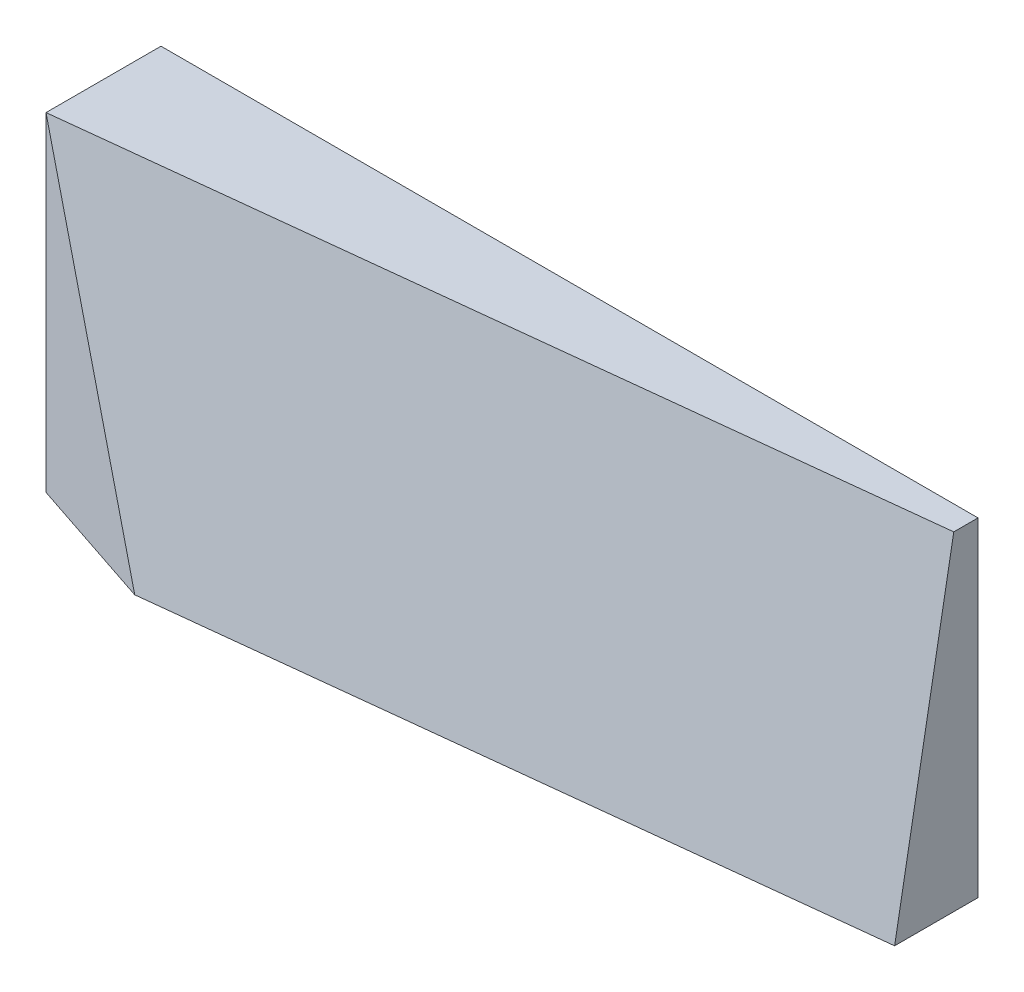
ISO-10303-21;
HEADER;
FILE_DESCRIPTION(('STEP AP214'),'2;1');
FILE_NAME('part.step','',(''),(''),'','','');
FILE_SCHEMA(('AUTOMOTIVE_DESIGN { 1 0 10303 214 1 1 1 1 }'));
ENDSEC;
DATA;
#1=APPLICATION_CONTEXT('core data for automotive mechanical design processes');
#2=APPLICATION_PROTOCOL_DEFINITION('international standard','automotive_design',2000,#1);
#3=PRODUCT_CONTEXT('',#1,'mechanical');
#4=PRODUCT('Part','Part','',(#3));
#5=PRODUCT_RELATED_PRODUCT_CATEGORY('part','',(#4));
#6=PRODUCT_DEFINITION_FORMATION('','',#4);
#7=PRODUCT_DEFINITION_CONTEXT('part definition',#1,'design');
#8=PRODUCT_DEFINITION('design','',#6,#7);
#9=PRODUCT_DEFINITION_SHAPE('','',#8);
#10=(LENGTH_UNIT() NAMED_UNIT(*) SI_UNIT(.MILLI.,.METRE.));
#11=(NAMED_UNIT(*) PLANE_ANGLE_UNIT() SI_UNIT($,.RADIAN.));
#12=(NAMED_UNIT(*) SI_UNIT($,.STERADIAN.) SOLID_ANGLE_UNIT());
#13=UNCERTAINTY_MEASURE_WITH_UNIT(LENGTH_MEASURE(1.E-05),#10,'distance_accuracy_value','');
#14=(GEOMETRIC_REPRESENTATION_CONTEXT(3) GLOBAL_UNCERTAINTY_ASSIGNED_CONTEXT((#13)) GLOBAL_UNIT_ASSIGNED_CONTEXT((#10,
#11,#12)) REPRESENTATION_CONTEXT('',''));
#15=CARTESIAN_POINT('',(0.,0.,0.));
#16=DIRECTION('',(0.,0.,1.));
#17=DIRECTION('',(1.,0.,0.));
#18=AXIS2_PLACEMENT_3D('',#15,#16,#17);
#19=CARTESIAN_POINT('',(0.,2780.,300.));
#20=DIRECTION('',(0.,-1.,0.));
#21=DIRECTION('',(0.,0.,-1.));
#22=AXIS2_PLACEMENT_3D('',#19,#20,#21);
#23=PLANE('',#22);
#24=DIRECTION('',(-0.993883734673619,0.,0.110431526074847));
#25=VECTOR('',#24,1.);
#26=CARTESIAN_POINT('',(-16.4634146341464,2780.,151.829268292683));
#27=LINE('',#26,#25);
#28=CARTESIAN_POINT('',(1350.,2780.,-3.05311331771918E-13));
#29=VERTEX_POINT('',#28);
#30=CARTESIAN_POINT('',(0.,2780.,150.));
#31=VERTEX_POINT('',#30);
#32=EDGE_CURVE('E180',#29,#31,#27,.T.);
#33=ORIENTED_EDGE('',*,*,#32,.F.);
#34=DIRECTION('',(0.,0.,-1.));
#35=VECTOR('',#34,1.);
#36=CARTESIAN_POINT('',(1350.,2780.,300.));
#37=LINE('',#36,#35);
#38=CARTESIAN_POINT('',(1350.,2780.,-40.));
#39=VERTEX_POINT('',#38);
#40=EDGE_CURVE('E48',#29,#39,#37,.T.);
#41=ORIENTED_EDGE('',*,*,#40,.T.);
#42=DIRECTION('',(1.,0.,0.));
#43=VECTOR('',#42,1.);
#44=CARTESIAN_POINT('',(0.,2780.,-40.));
#45=LINE('',#44,#43);
#46=CARTESIAN_POINT('',(0.,2780.,-40.));
#47=VERTEX_POINT('',#46);
#48=EDGE_CURVE('E192',#47,#39,#45,.T.);
#49=ORIENTED_EDGE('',*,*,#48,.F.);
#50=DIRECTION('',(0.,0.,-1.));
#51=VECTOR('',#50,1.);
#52=CARTESIAN_POINT('',(0.,2780.,300.));
#53=LINE('',#52,#51);
#54=EDGE_CURVE('E198',#31,#47,#53,.T.);
#55=ORIENTED_EDGE('',*,*,#54,.F.);
#56=EDGE_LOOP('',(#33,#41,#49,#55));
#57=FACE_BOUND('',#56,.T.);
#58=ADVANCED_FACE('F40',(#57),#23,.F.);
#59=CARTESIAN_POINT('',(69.1324244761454,111.905003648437,622.191820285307));
#60=DIRECTION('',(0.108708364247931,0.175966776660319,0.978375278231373));
#61=DIRECTION('',(0.,-0.984208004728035,0.177015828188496));
#62=AXIS2_PLACEMENT_3D('',#59,#60,#61);
#63=PLANE('',#62);
#64=DIRECTION('',(-0.372225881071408,0.919811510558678,-0.124075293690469));
#65=VECTOR('',#64,1.);
#66=CARTESIAN_POINT('',(944.882261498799,445.090944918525,464.960753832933));
#67=LINE('',#66,#65);
#68=CARTESIAN_POINT('',(219.94154676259,2236.5,223.313848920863));
#69=VERTEX_POINT('',#68);
#70=EDGE_CURVE('E11',#69,#31,#67,.T.);
#71=ORIENTED_EDGE('',*,*,#70,.F.);
#72=DIRECTION('',(0.993883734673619,0.,-0.110431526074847));
#73=VECTOR('',#72,1.);
#74=CARTESIAN_POINT('',(27.192270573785,2236.5,244.730435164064));
#75=LINE('',#74,#73);
#76=CARTESIAN_POINT('',(1350.,2236.5,97.7517985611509));
#77=VERTEX_POINT('',#76);
#78=EDGE_CURVE('E172',#69,#77,#75,.T.);
#79=ORIENTED_EDGE('',*,*,#78,.T.);
#80=DIRECTION('',(0.,0.984208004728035,-0.177015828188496));
#81=VECTOR('',#80,1.);
#82=CARTESIAN_POINT('',(1350.,2189.15592098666,106.266920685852));
#83=LINE('',#82,#81);
#84=EDGE_CURVE('E183',#77,#29,#83,.T.);
#85=ORIENTED_EDGE('',*,*,#84,.T.);
#86=ORIENTED_EDGE('',*,*,#32,.T.);
#87=EDGE_LOOP('',(#71,#79,#85,#86));
#88=FACE_BOUND('',#87,.T.);
#89=ADVANCED_FACE('F216',(#88),#63,.T.);
#90=CARTESIAN_POINT('',(0.,0.,-40.));
#91=DIRECTION('',(0.,0.,-1.));
#92=DIRECTION('',(-1.,0.,0.));
#93=AXIS2_PLACEMENT_3D('',#90,#91,#92);
#94=PLANE('',#93);
#95=DIRECTION('',(0.,-1.,0.));
#96=VECTOR('',#95,1.);
#97=CARTESIAN_POINT('',(1346.,2224.,-40.));
#98=LINE('',#97,#96);
#99=CARTESIAN_POINT('',(1346.,2776.,-40.));
#100=VERTEX_POINT('',#99);
#101=CARTESIAN_POINT('',(1346.,2240.5,-40.));
#102=VERTEX_POINT('',#101);
#103=EDGE_CURVE('E159',#100,#102,#98,.T.);
#104=ORIENTED_EDGE('',*,*,#103,.F.);
#105=DIRECTION('',(1.,0.,0.));
#106=VECTOR('',#105,1.);
#107=CARTESIAN_POINT('',(0.,2776.,-40.));
#108=LINE('',#107,#106);
#109=CARTESIAN_POINT('',(4.,2776.,-40.));
#110=VERTEX_POINT('',#109);
#111=EDGE_CURVE('E157',#110,#100,#108,.T.);
#112=ORIENTED_EDGE('',*,*,#111,.F.);
#113=DIRECTION('',(0.,1.,0.));
#114=VECTOR('',#113,1.);
#115=CARTESIAN_POINT('',(4.,0.,-40.));
#116=LINE('',#115,#114);
#117=CARTESIAN_POINT('',(4.,2240.5,-40.));
#118=VERTEX_POINT('',#117);
#119=EDGE_CURVE('E153',#118,#110,#116,.T.);
#120=ORIENTED_EDGE('',*,*,#119,.F.);
#121=DIRECTION('',(1.,0.,0.));
#122=VECTOR('',#121,1.);
#123=CARTESIAN_POINT('',(675.,2240.5,-40.));
#124=LINE('',#123,#122);
#125=EDGE_CURVE('E155',#118,#102,#124,.T.);
#126=ORIENTED_EDGE('',*,*,#125,.T.);
#127=EDGE_LOOP('',(#104,#112,#120,#126));
#128=FACE_BOUND('',#127,.T.);
#129=DIRECTION('',(0.,-1.,0.));
#130=VECTOR('',#129,1.);
#131=CARTESIAN_POINT('',(1350.,2780.,-40.));
#132=LINE('',#131,#130);
#133=CARTESIAN_POINT('',(1350.,2236.5,-40.));
#134=VERTEX_POINT('',#133);
#135=EDGE_CURVE('E195',#39,#134,#132,.T.);
#136=ORIENTED_EDGE('',*,*,#135,.T.);
#137=DIRECTION('',(1.,0.,0.));
#138=VECTOR('',#137,1.);
#139=CARTESIAN_POINT('',(675.,2236.5,-40.));
#140=LINE('',#139,#138);
#141=CARTESIAN_POINT('',(0.,2236.5,-40.));
#142=VERTEX_POINT('',#141);
#143=EDGE_CURVE('E143',#142,#134,#140,.T.);
#144=ORIENTED_EDGE('',*,*,#143,.F.);
#145=DIRECTION('',(0.,1.,0.));
#146=VECTOR('',#145,1.);
#147=CARTESIAN_POINT('',(0.,0.,-40.));
#148=LINE('',#147,#146);
#149=EDGE_CURVE('E189',#142,#47,#148,.T.);
#150=ORIENTED_EDGE('',*,*,#149,.T.);
#151=ORIENTED_EDGE('',*,*,#48,.T.);
#152=EDGE_LOOP('',(#136,#144,#150,#151));
#153=FACE_BOUND('',#152,.T.);
#154=ADVANCED_FACE('F209',(#128,#153),#94,.T.);
#155=CARTESIAN_POINT('',(0.,0.,300.));
#156=DIRECTION('',(1.,0.,0.));
#157=DIRECTION('',(0.,0.,-1.));
#158=AXIS2_PLACEMENT_3D('',#155,#156,#157);
#159=PLANE('',#158);
#160=DIRECTION('',(0.,0.,1.));
#161=VECTOR('',#160,1.);
#162=CARTESIAN_POINT('',(-1.11022302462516E-13,2236.5,-40.));
#163=LINE('',#162,#161);
#164=CARTESIAN_POINT('',(-1.11022302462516E-13,2236.5,150.));
#165=VERTEX_POINT('',#164);
#166=EDGE_CURVE('E63',#142,#165,#163,.T.);
#167=ORIENTED_EDGE('',*,*,#166,.T.);
#168=DIRECTION('',(0.,-1.,0.));
#169=VECTOR('',#168,1.);
#170=CARTESIAN_POINT('',(0.,0.,150.));
#171=LINE('',#170,#169);
#172=EDGE_CURVE('E185',#31,#165,#171,.T.);
#173=ORIENTED_EDGE('',*,*,#172,.F.);
#174=ORIENTED_EDGE('',*,*,#54,.T.);
#175=ORIENTED_EDGE('',*,*,#149,.F.);
#176=EDGE_LOOP('',(#167,#173,#174,#175));
#177=FACE_BOUND('',#176,.T.);
#178=ADVANCED_FACE('F42',(#177),#159,.F.);
#179=CARTESIAN_POINT('',(-45.0000000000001,0.,135.));
#180=DIRECTION('',(-0.316227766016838,0.,0.948683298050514));
#181=DIRECTION('',(0.948683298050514,0.,0.316227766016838));
#182=AXIS2_PLACEMENT_3D('',#179,#180,#181);
#183=PLANE('',#182);
#184=ORIENTED_EDGE('',*,*,#172,.T.);
#185=DIRECTION('',(0.948683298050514,0.,0.316227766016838));
#186=VECTOR('',#185,1.);
#187=CARTESIAN_POINT('',(-45.0000000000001,2236.5,135.));
#188=LINE('',#187,#186);
#189=EDGE_CURVE('E176',#165,#69,#188,.T.);
#190=ORIENTED_EDGE('',*,*,#189,.T.);
#191=ORIENTED_EDGE('',*,*,#70,.T.);
#192=EDGE_LOOP('',(#184,#190,#191));
#193=FACE_BOUND('',#192,.T.);
#194=ADVANCED_FACE('F219',(#193),#183,.T.);
#195=CARTESIAN_POINT('',(1350.,2224.,300.));
#196=DIRECTION('',(-1.,0.,0.));
#197=DIRECTION('',(0.,0.,1.));
#198=AXIS2_PLACEMENT_3D('',#195,#196,#197);
#199=PLANE('',#198);
#200=DIRECTION('',(0.,0.,1.));
#201=VECTOR('',#200,1.);
#202=CARTESIAN_POINT('',(1350.,2236.5,-40.));
#203=LINE('',#202,#201);
#204=EDGE_CURVE('E169',#134,#77,#203,.T.);
#205=ORIENTED_EDGE('',*,*,#204,.F.);
#206=ORIENTED_EDGE('',*,*,#135,.F.);
#207=ORIENTED_EDGE('',*,*,#40,.F.);
#208=ORIENTED_EDGE('',*,*,#84,.F.);
#209=EDGE_LOOP('',(#205,#206,#207,#208));
#210=FACE_BOUND('',#209,.T.);
#211=ADVANCED_FACE('F212',(#210),#199,.F.);
#212=CARTESIAN_POINT('',(675.,2236.5,-40.));
#213=DIRECTION('',(0.,-1.,0.));
#214=DIRECTION('',(0.,0.,-1.));
#215=AXIS2_PLACEMENT_3D('',#212,#213,#214);
#216=PLANE('',#215);
#217=ORIENTED_EDGE('',*,*,#166,.F.);
#218=ORIENTED_EDGE('',*,*,#143,.T.);
#219=ORIENTED_EDGE('',*,*,#204,.T.);
#220=ORIENTED_EDGE('',*,*,#78,.F.);
#221=ORIENTED_EDGE('',*,*,#189,.F.);
#222=EDGE_LOOP('',(#217,#218,#219,#220,#221));
#223=FACE_BOUND('',#222,.T.);
#224=ADVANCED_FACE('F213',(#223),#216,.T.);
#225=CARTESIAN_POINT('',(0.,2776.,300.));
#226=DIRECTION('',(0.,-1.,0.));
#227=DIRECTION('',(0.,0.,-1.));
#228=AXIS2_PLACEMENT_3D('',#225,#226,#227);
#229=PLANE('',#228);
#230=DIRECTION('',(-0.993883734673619,0.,0.110431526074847));
#231=VECTOR('',#230,1.);
#232=CARTESIAN_POINT('',(-16.8331814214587,2776.,148.501367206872));
#233=LINE('',#232,#231);
#234=CARTESIAN_POINT('',(1346.,2776.,-2.9245418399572));
#235=VERTEX_POINT('',#234);
#236=CARTESIAN_POINT('',(4.,2776.,146.186569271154));
#237=VERTEX_POINT('',#236);
#238=EDGE_CURVE('E136',#235,#237,#233,.T.);
#239=ORIENTED_EDGE('',*,*,#238,.T.);
#240=DIRECTION('',(0.,0.,-1.));
#241=VECTOR('',#240,1.);
#242=CARTESIAN_POINT('',(4.,2776.,300.));
#243=LINE('',#242,#241);
#244=EDGE_CURVE('E55',#237,#110,#243,.T.);
#245=ORIENTED_EDGE('',*,*,#244,.T.);
#246=ORIENTED_EDGE('',*,*,#111,.T.);
#247=DIRECTION('',(0.,0.,-1.));
#248=VECTOR('',#247,1.);
#249=CARTESIAN_POINT('',(1346.,2776.,300.));
#250=LINE('',#249,#248);
#251=EDGE_CURVE('E141',#235,#100,#250,.T.);
#252=ORIENTED_EDGE('',*,*,#251,.F.);
#253=EDGE_LOOP('',(#239,#245,#246,#252));
#254=FACE_BOUND('',#253,.T.);
#255=ADVANCED_FACE('F239',(#254),#229,.T.);
#256=CARTESIAN_POINT('',(68.6975910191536,111.201136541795,618.278319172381));
#257=DIRECTION('',(0.108708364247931,0.175966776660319,0.978375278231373));
#258=DIRECTION('',(0.,-0.984208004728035,0.177015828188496));
#259=AXIS2_PLACEMENT_3D('',#256,#257,#258);
#260=PLANE('',#259);
#261=DIRECTION('',(-0.372225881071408,0.919811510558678,-0.124075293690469));
#262=VECTOR('',#261,1.);
#263=CARTESIAN_POINT('',(945.32057666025,444.719274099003,460.890488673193));
#264=LINE('',#263,#262);
#265=CARTESIAN_POINT('',(218.61075053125,2240.5,218.653879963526));
#266=VERTEX_POINT('',#265);
#267=CARTESIAN_POINT('',(4.,2770.82701020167,147.116963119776));
#268=VERTEX_POINT('',#267);
#269=EDGE_CURVE('E122',#266,#268,#264,.T.);
#270=ORIENTED_EDGE('',*,*,#269,.T.);
#271=DIRECTION('',(0.,-0.984208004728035,0.177015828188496));
#272=VECTOR('',#271,1.);
#273=CARTESIAN_POINT('',(4.,60.1874224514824,634.642068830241));
#274=LINE('',#273,#272);
#275=EDGE_CURVE('E140',#237,#268,#274,.T.);
#276=ORIENTED_EDGE('',*,*,#275,.F.);
#277=ORIENTED_EDGE('',*,*,#238,.F.);
#278=DIRECTION('',(0.,0.984208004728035,-0.177015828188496));
#279=VECTOR('',#278,1.);
#280=CARTESIAN_POINT('',(1346.,2188.5210677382,102.737136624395));
#281=LINE('',#280,#279);
#282=CARTESIAN_POINT('',(1346.,2240.5,93.3884078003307));
#283=VERTEX_POINT('',#282);
#284=EDGE_CURVE('E125',#283,#235,#281,.T.);
#285=ORIENTED_EDGE('',*,*,#284,.F.);
#286=DIRECTION('',(0.993883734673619,0.,-0.110431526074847));
#287=VECTOR('',#286,1.);
#288=CARTESIAN_POINT('',(26.6645813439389,2240.5,239.981232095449));
#289=LINE('',#288,#287);
#290=EDGE_CURVE('E118',#266,#283,#289,.T.);
#291=ORIENTED_EDGE('',*,*,#290,.F.);
#292=EDGE_LOOP('',(#270,#276,#277,#285,#291));
#293=FACE_BOUND('',#292,.T.);
#294=ADVANCED_FACE('F120',(#293),#260,.F.);
#295=CARTESIAN_POINT('',(4.,0.,300.));
#296=DIRECTION('',(1.,0.,0.));
#297=DIRECTION('',(0.,0.,-1.));
#298=AXIS2_PLACEMENT_3D('',#295,#296,#297);
#299=PLANE('',#298);
#300=DIRECTION('',(0.,0.,1.));
#301=VECTOR('',#300,1.);
#302=CARTESIAN_POINT('',(4.,2240.5,-40.));
#303=LINE('',#302,#301);
#304=CARTESIAN_POINT('',(4.,2240.5,147.116963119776));
#305=VERTEX_POINT('',#304);
#306=EDGE_CURVE('E128',#118,#305,#303,.T.);
#307=ORIENTED_EDGE('',*,*,#306,.F.);
#308=ORIENTED_EDGE('',*,*,#119,.T.);
#309=ORIENTED_EDGE('',*,*,#244,.F.);
#310=ORIENTED_EDGE('',*,*,#275,.T.);
#311=DIRECTION('',(0.,-1.,0.));
#312=VECTOR('',#311,1.);
#313=CARTESIAN_POINT('',(4.,0.,147.116963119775));
#314=LINE('',#313,#312);
#315=EDGE_CURVE('E139',#268,#305,#314,.T.);
#316=ORIENTED_EDGE('',*,*,#315,.T.);
#317=EDGE_LOOP('',(#307,#308,#309,#310,#316));
#318=FACE_BOUND('',#317,.T.);
#319=ADVANCED_FACE('F254',(#318),#299,.T.);
#320=CARTESIAN_POINT('',(-43.7350889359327,0.,131.205266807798));
#321=DIRECTION('',(-0.316227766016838,0.,0.948683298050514));
#322=DIRECTION('',(0.948683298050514,0.,0.316227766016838));
#323=AXIS2_PLACEMENT_3D('',#320,#321,#322);
#324=PLANE('',#323);
#325=ORIENTED_EDGE('',*,*,#315,.F.);
#326=ORIENTED_EDGE('',*,*,#269,.F.);
#327=DIRECTION('',(0.948683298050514,0.,0.316227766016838));
#328=VECTOR('',#327,1.);
#329=CARTESIAN_POINT('',(-43.7350889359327,2240.5,131.205266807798));
#330=LINE('',#329,#328);
#331=EDGE_CURVE('E127',#305,#266,#330,.T.);
#332=ORIENTED_EDGE('',*,*,#331,.F.);
#333=EDGE_LOOP('',(#325,#326,#332));
#334=FACE_BOUND('',#333,.T.);
#335=ADVANCED_FACE('F138',(#334),#324,.F.);
#336=CARTESIAN_POINT('',(1346.,2224.,300.));
#337=DIRECTION('',(-1.,0.,0.));
#338=DIRECTION('',(0.,0.,1.));
#339=AXIS2_PLACEMENT_3D('',#336,#337,#338);
#340=PLANE('',#339);
#341=DIRECTION('',(0.,0.,1.));
#342=VECTOR('',#341,1.);
#343=CARTESIAN_POINT('',(1346.,2240.5,300.));
#344=LINE('',#343,#342);
#345=EDGE_CURVE('E151',#102,#283,#344,.T.);
#346=ORIENTED_EDGE('',*,*,#345,.T.);
#347=ORIENTED_EDGE('',*,*,#284,.T.);
#348=ORIENTED_EDGE('',*,*,#251,.T.);
#349=ORIENTED_EDGE('',*,*,#103,.T.);
#350=EDGE_LOOP('',(#346,#347,#348,#349));
#351=FACE_BOUND('',#350,.T.);
#352=ADVANCED_FACE('F248',(#351),#340,.T.);
#353=CARTESIAN_POINT('',(675.,2240.5,-40.));
#354=DIRECTION('',(0.,-1.,0.));
#355=DIRECTION('',(0.,0.,-1.));
#356=AXIS2_PLACEMENT_3D('',#353,#354,#355);
#357=PLANE('',#356);
#358=ORIENTED_EDGE('',*,*,#306,.T.);
#359=ORIENTED_EDGE('',*,*,#331,.T.);
#360=ORIENTED_EDGE('',*,*,#290,.T.);
#361=ORIENTED_EDGE('',*,*,#345,.F.);
#362=ORIENTED_EDGE('',*,*,#125,.F.);
#363=EDGE_LOOP('',(#358,#359,#360,#361,#362));
#364=FACE_BOUND('',#363,.T.);
#365=ADVANCED_FACE('F131',(#364),#357,.F.);
#366=CLOSED_SHELL('',(#58,#89,#154,#178,#194,#211,#224,#255,#294,#319,#335,#352,#365));
#367=MANIFOLD_SOLID_BREP('B2',#366);
#368=ADVANCED_BREP_SHAPE_REPRESENTATION('',(#18,#367),#14);
#369=SHAPE_DEFINITION_REPRESENTATION(#9,#368);
ENDSEC;
END-ISO-10303-21;
